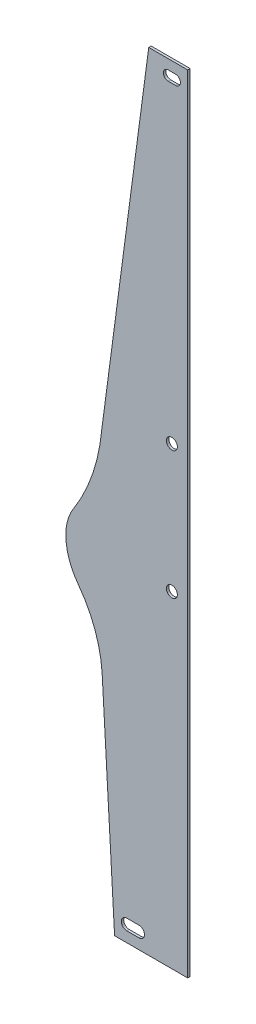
from build123d import *

# Parameters (mm, degrees)
ESQUISSE1_R      = 4.5
EXTRUSION1_DEPTH = 2


with BuildPart() as part:
    # Esquisse1 → Extrusion1 (new body)
    with BuildSketch(Plane.XY):
        with BuildLine():
            Line((44.038229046, 237.989624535), (44.038229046, -407.010375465))
            Line((44.038229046, -407.010375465), (-15.961770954, -407.010375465))
            Line((-15.961770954, -407.010375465), (-26.119542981, -226.395260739))
            ThreePointArc((-26.119542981, -226.395260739), (-32.019045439, -197.73554034), (-45.961770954, -172.010375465))
            ThreePointArc((-45.961770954, -172.010375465), (-53.395935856, -157.821763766), (-55.961770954, -142.010375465))
            ThreePointArc((-55.961770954, -142.010375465), (-54.350365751, -130.771345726), (-49.64598148, -120.437847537))
            ThreePointArc((-49.64598148, -120.437847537), (-35.957101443, -93.380374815), (-27.989697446, -64.122679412))
            Line((-27.989697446, -64.122679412), (12.038229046, 237.989624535))
            Line((12.038229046, 237.989624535), (44.038229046, 237.989624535))
        make_face()
        with Locations((31.038229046, -34.010375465)):
            Circle(ESQUISSE1_R, mode=Mode.SUBTRACT)
        with Locations((31.038229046, -139.010375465)):
            Circle(ESQUISSE1_R, mode=Mode.SUBTRACT)
        with BuildLine():
            Line((4.038229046, -398.510375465), (-5.961770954, -398.510375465))
            ThreePointArc((-5.961770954, -398.510375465), (-10.461770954, -394.010375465), (-5.961770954, -389.510375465))
            Line((-5.961770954, -389.510375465), (4.038229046, -389.510375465))
            ThreePointArc((4.038229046, -389.510375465), (8.538229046, -394.010375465), (4.038229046, -398.510375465))
        make_face(mode=Mode.SUBTRACT)
        with BuildLine():
            Line((34.038229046, 221.989624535), (28.038229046, 221.989624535))
            ThreePointArc((28.038229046, 221.989624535), (24.038229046, 225.989624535), (28.038229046, 229.989624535))
            Line((28.038229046, 229.989624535), (34.038229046, 229.989624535))
            ThreePointArc((34.038229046, 229.989624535), (38.038229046, 225.989624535), (34.038229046, 221.989624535))
        make_face(mode=Mode.SUBTRACT)
    extrude(amount=EXTRUSION1_DEPTH)


solid = part.part
